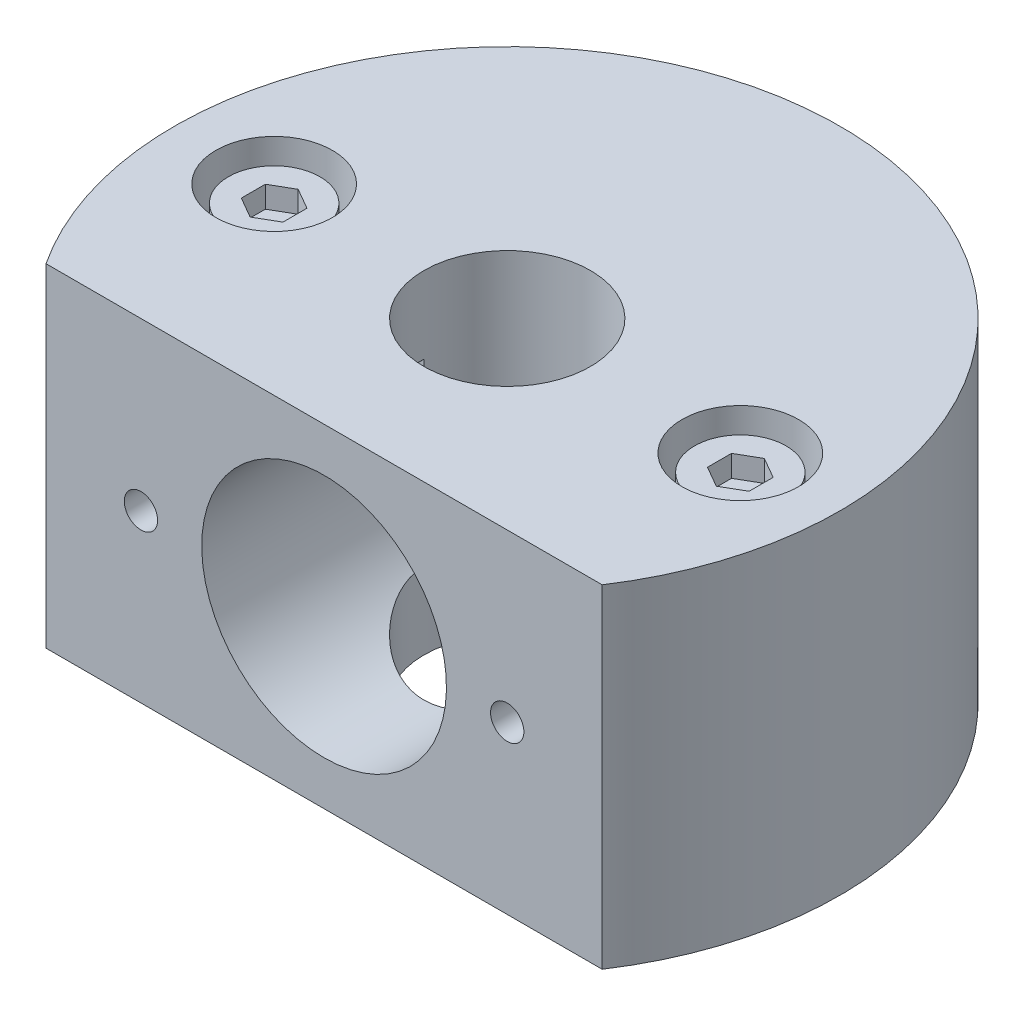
ISO-10303-21;
HEADER;
FILE_DESCRIPTION(('STEP AP214'),'2;1');
FILE_NAME('part.step','',(''),(''),'','','');
FILE_SCHEMA(('AUTOMOTIVE_DESIGN { 1 0 10303 214 1 1 1 1 }'));
ENDSEC;
DATA;
#1=APPLICATION_CONTEXT('core data for automotive mechanical design processes');
#2=APPLICATION_PROTOCOL_DEFINITION('international standard','automotive_design',2000,#1);
#3=PRODUCT_CONTEXT('',#1,'mechanical');
#4=PRODUCT('Part','Part','',(#3));
#5=PRODUCT_RELATED_PRODUCT_CATEGORY('part','',(#4));
#6=PRODUCT_DEFINITION_FORMATION('','',#4);
#7=PRODUCT_DEFINITION_CONTEXT('part definition',#1,'design');
#8=PRODUCT_DEFINITION('design','',#6,#7);
#9=PRODUCT_DEFINITION_SHAPE('','',#8);
#10=(LENGTH_UNIT() NAMED_UNIT(*) SI_UNIT(.MILLI.,.METRE.));
#11=(NAMED_UNIT(*) PLANE_ANGLE_UNIT() SI_UNIT($,.RADIAN.));
#12=(NAMED_UNIT(*) SI_UNIT($,.STERADIAN.) SOLID_ANGLE_UNIT());
#13=UNCERTAINTY_MEASURE_WITH_UNIT(LENGTH_MEASURE(1.E-05),#10,'distance_accuracy_value','');
#14=(GEOMETRIC_REPRESENTATION_CONTEXT(3) GLOBAL_UNCERTAINTY_ASSIGNED_CONTEXT((#13)) GLOBAL_UNIT_ASSIGNED_CONTEXT((#10,
#11,#12)) REPRESENTATION_CONTEXT('',''));
#15=CARTESIAN_POINT('',(0.,0.,0.));
#16=DIRECTION('',(0.,0.,1.));
#17=DIRECTION('',(1.,0.,0.));
#18=AXIS2_PLACEMENT_3D('',#15,#16,#17);
#19=CARTESIAN_POINT('',(-1.39659253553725E-13,20.,0.));
#20=DIRECTION('',(0.,-1.,0.));
#21=DIRECTION('',(1.,0.,0.));
#22=AXIS2_PLACEMENT_3D('',#19,#20,#21);
#23=CYLINDRICAL_SURFACE('',#22,20.);
#24=DIRECTION('',(0.,-1.,0.));
#25=VECTOR('',#24,1.);
#26=CARTESIAN_POINT('',(16.7032930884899,20.,11.));
#27=LINE('',#26,#25);
#28=CARTESIAN_POINT('',(16.7032930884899,20.,11.));
#29=VERTEX_POINT('',#28);
#30=CARTESIAN_POINT('',(16.70329308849,1.55044766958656E-13,11.));
#31=VERTEX_POINT('',#30);
#32=EDGE_CURVE('E253',#29,#31,#27,.T.);
#33=ORIENTED_EDGE('',*,*,#32,.T.);
#34=CARTESIAN_POINT('',(0.,0.,0.));
#35=DIRECTION('',(0.,1.,0.));
#36=DIRECTION('',(-1.,0.,0.));
#37=AXIS2_PLACEMENT_3D('',#34,#35,#36);
#38=CIRCLE('',#37,20.);
#39=CARTESIAN_POINT('',(-16.70329308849,0.,11.));
#40=VERTEX_POINT('',#39);
#41=EDGE_CURVE('E27',#31,#40,#38,.T.);
#42=ORIENTED_EDGE('',*,*,#41,.T.);
#43=DIRECTION('',(0.,-1.,0.));
#44=VECTOR('',#43,1.);
#45=CARTESIAN_POINT('',(-16.7032930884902,20.,11.));
#46=LINE('',#45,#44);
#47=CARTESIAN_POINT('',(-16.7032930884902,20.,11.));
#48=VERTEX_POINT('',#47);
#49=EDGE_CURVE('E255',#48,#40,#46,.T.);
#50=ORIENTED_EDGE('',*,*,#49,.F.);
#51=CARTESIAN_POINT('',(-1.39659253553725E-13,20.,0.));
#52=DIRECTION('',(0.,1.,0.));
#53=DIRECTION('',(-1.,0.,0.));
#54=AXIS2_PLACEMENT_3D('',#51,#52,#53);
#55=CIRCLE('',#54,20.);
#56=EDGE_CURVE('E414',#29,#48,#55,.T.);
#57=ORIENTED_EDGE('',*,*,#56,.F.);
#58=EDGE_LOOP('',(#33,#42,#50,#57));
#59=FACE_BOUND('',#58,.T.);
#60=ADVANCED_FACE('F14',(#59),#23,.T.);
#61=CARTESIAN_POINT('',(10.2,10.,7.));
#62=DIRECTION('',(0.,0.,-1.));
#63=DIRECTION('',(0.,-1.,0.));
#64=AXIS2_PLACEMENT_3D('',#61,#62,#63);
#65=PLANE('',#64);
#66=CARTESIAN_POINT('',(11.,10.,7.));
#67=DIRECTION('',(0.,0.,1.));
#68=DIRECTION('',(0.,1.,0.));
#69=AXIS2_PLACEMENT_3D('',#66,#67,#68);
#70=CIRCLE('',#69,1.);
#71=CARTESIAN_POINT('',(11.,11.,7.));
#72=VERTEX_POINT('',#71);
#73=EDGE_CURVE('E243',#72,#72,#70,.T.);
#74=ORIENTED_EDGE('',*,*,#73,.T.);
#75=EDGE_LOOP('',(#74));
#76=FACE_BOUND('',#75,.T.);
#77=ADVANCED_FACE('F296',(#76),#65,.F.);
#78=CARTESIAN_POINT('',(11.,10.0000000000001,11.));
#79=DIRECTION('',(0.,0.,1.));
#80=DIRECTION('',(0.,1.,0.));
#81=AXIS2_PLACEMENT_3D('',#78,#79,#80);
#82=CYLINDRICAL_SURFACE('',#81,1.);
#83=ORIENTED_EDGE('',*,*,#73,.F.);
#84=EDGE_LOOP('',(#83));
#85=FACE_BOUND('',#84,.T.);
#86=CARTESIAN_POINT('',(11.,10.0000000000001,11.));
#87=DIRECTION('',(0.,0.,-1.));
#88=DIRECTION('',(0.,-1.,0.));
#89=AXIS2_PLACEMENT_3D('',#86,#87,#88);
#90=CIRCLE('',#89,1.);
#91=CARTESIAN_POINT('',(11.,9.00000000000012,11.));
#92=VERTEX_POINT('',#91);
#93=EDGE_CURVE('E235',#92,#92,#90,.F.);
#94=ORIENTED_EDGE('',*,*,#93,.T.);
#95=EDGE_LOOP('',(#94));
#96=FACE_BOUND('',#95,.T.);
#97=ADVANCED_FACE('F299',(#85,#96),#82,.F.);
#98=CARTESIAN_POINT('',(-14.0000000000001,20.,0.));
#99=DIRECTION('',(0.,1.,0.));
#100=DIRECTION('',(-1.,0.,0.));
#101=AXIS2_PLACEMENT_3D('',#98,#99,#100);
#102=CYLINDRICAL_SURFACE('',#101,3.5);
#103=CARTESIAN_POINT('',(-14.,16.,0.));
#104=DIRECTION('',(0.,1.,0.));
#105=DIRECTION('',(-1.,0.,0.));
#106=AXIS2_PLACEMENT_3D('',#103,#104,#105);
#107=CIRCLE('',#106,3.5);
#108=CARTESIAN_POINT('',(-17.5,16.,0.));
#109=VERTEX_POINT('',#108);
#110=EDGE_CURVE('E239',#109,#109,#107,.T.);
#111=ORIENTED_EDGE('',*,*,#110,.F.);
#112=EDGE_LOOP('',(#111));
#113=FACE_BOUND('',#112,.T.);
#114=CARTESIAN_POINT('',(-14.0000000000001,20.,0.));
#115=DIRECTION('',(0.,1.,0.));
#116=DIRECTION('',(-1.,0.,0.));
#117=AXIS2_PLACEMENT_3D('',#114,#115,#116);
#118=CIRCLE('',#117,3.5);
#119=CARTESIAN_POINT('',(-17.5000000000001,20.,0.));
#120=VERTEX_POINT('',#119);
#121=EDGE_CURVE('E478',#120,#120,#118,.T.);
#122=ORIENTED_EDGE('',*,*,#121,.T.);
#123=EDGE_LOOP('',(#122));
#124=FACE_BOUND('',#123,.T.);
#125=ADVANCED_FACE('F304',(#113,#124),#102,.F.);
#126=CARTESIAN_POINT('',(-17.5,16.,0.));
#127=DIRECTION('',(0.,-1.,0.));
#128=DIRECTION('',(1.,0.,0.));
#129=AXIS2_PLACEMENT_3D('',#126,#127,#128);
#130=PLANE('',#129);
#131=CARTESIAN_POINT('',(-14.,16.,0.));
#132=DIRECTION('',(0.,-1.,0.));
#133=DIRECTION('',(1.,0.,0.));
#134=AXIS2_PLACEMENT_3D('',#131,#132,#133);
#135=CIRCLE('',#134,2.75);
#136=CARTESIAN_POINT('',(-11.25,16.,0.));
#137=VERTEX_POINT('',#136);
#138=EDGE_CURVE('E9',#137,#137,#135,.F.);
#139=ORIENTED_EDGE('',*,*,#138,.F.);
#140=EDGE_LOOP('',(#139));
#141=FACE_BOUND('',#140,.T.);
#142=ORIENTED_EDGE('',*,*,#110,.T.);
#143=EDGE_LOOP('',(#142));
#144=FACE_BOUND('',#143,.T.);
#145=ADVANCED_FACE('F301',(#141,#144),#130,.F.);
#146=CARTESIAN_POINT('',(-14.0000000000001,20.,0.));
#147=DIRECTION('',(0.,1.,0.));
#148=DIRECTION('',(-1.,0.,0.));
#149=AXIS2_PLACEMENT_3D('',#146,#147,#148);
#150=CYLINDRICAL_SURFACE('',#149,1.75);
#151=CARTESIAN_POINT('',(-14.,16.,0.));
#152=DIRECTION('',(0.,1.,0.));
#153=DIRECTION('',(-1.,0.,0.));
#154=AXIS2_PLACEMENT_3D('',#151,#152,#153);
#155=CIRCLE('',#154,1.75);
#156=CARTESIAN_POINT('',(-15.75,16.,0.));
#157=VERTEX_POINT('',#156);
#158=EDGE_CURVE('E135',#157,#157,#155,.F.);
#159=ORIENTED_EDGE('',*,*,#158,.F.);
#160=EDGE_LOOP('',(#159));
#161=FACE_BOUND('',#160,.T.);
#162=CARTESIAN_POINT('',(-14.,0.,0.));
#163=DIRECTION('',(0.,1.,0.));
#164=DIRECTION('',(-1.,0.,0.));
#165=AXIS2_PLACEMENT_3D('',#162,#163,#164);
#166=CIRCLE('',#165,1.75);
#167=CARTESIAN_POINT('',(-15.75,-1.09981662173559E-13,0.));
#168=VERTEX_POINT('',#167);
#169=EDGE_CURVE('E481',#168,#168,#166,.T.);
#170=ORIENTED_EDGE('',*,*,#169,.F.);
#171=EDGE_LOOP('',(#170));
#172=FACE_BOUND('',#171,.T.);
#173=ADVANCED_FACE('F294',(#161,#172),#150,.F.);
#174=CARTESIAN_POINT('',(-11.8,10.,7.));
#175=DIRECTION('',(0.,0.,-1.));
#176=DIRECTION('',(0.,-1.,0.));
#177=AXIS2_PLACEMENT_3D('',#174,#175,#176);
#178=PLANE('',#177);
#179=CARTESIAN_POINT('',(-11.,10.,7.));
#180=DIRECTION('',(0.,0.,1.));
#181=DIRECTION('',(0.,1.,0.));
#182=AXIS2_PLACEMENT_3D('',#179,#180,#181);
#183=CIRCLE('',#182,1.);
#184=CARTESIAN_POINT('',(-11.,11.,7.));
#185=VERTEX_POINT('',#184);
#186=EDGE_CURVE('E246',#185,#185,#183,.T.);
#187=ORIENTED_EDGE('',*,*,#186,.T.);
#188=EDGE_LOOP('',(#187));
#189=FACE_BOUND('',#188,.T.);
#190=ADVANCED_FACE('F290',(#189),#178,.F.);
#191=CARTESIAN_POINT('',(-11.,10.,11.));
#192=DIRECTION('',(0.,0.,1.));
#193=DIRECTION('',(0.,1.,0.));
#194=AXIS2_PLACEMENT_3D('',#191,#192,#193);
#195=CYLINDRICAL_SURFACE('',#194,1.);
#196=ORIENTED_EDGE('',*,*,#186,.F.);
#197=EDGE_LOOP('',(#196));
#198=FACE_BOUND('',#197,.T.);
#199=CARTESIAN_POINT('',(-11.,10.,11.));
#200=DIRECTION('',(0.,0.,-1.));
#201=DIRECTION('',(0.,-1.,0.));
#202=AXIS2_PLACEMENT_3D('',#199,#200,#201);
#203=CIRCLE('',#202,1.);
#204=CARTESIAN_POINT('',(-11.,9.,11.));
#205=VERTEX_POINT('',#204);
#206=EDGE_CURVE('E240',#205,#205,#203,.F.);
#207=ORIENTED_EDGE('',*,*,#206,.T.);
#208=EDGE_LOOP('',(#207));
#209=FACE_BOUND('',#208,.T.);
#210=ADVANCED_FACE('F293',(#198,#209),#195,.F.);
#211=CARTESIAN_POINT('',(0.,0.,0.));
#212=DIRECTION('',(0.,1.,0.));
#213=DIRECTION('',(-1.,0.,0.));
#214=AXIS2_PLACEMENT_3D('',#211,#212,#213);
#215=PLANE('',#214);
#216=ORIENTED_EDGE('',*,*,#41,.F.);
#217=DIRECTION('',(1.,0.,0.));
#218=VECTOR('',#217,1.);
#219=CARTESIAN_POINT('',(16.70329308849,1.55044766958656E-13,11.));
#220=LINE('',#219,#218);
#221=EDGE_CURVE('E418',#40,#31,#220,.T.);
#222=ORIENTED_EDGE('',*,*,#221,.F.);
#223=EDGE_LOOP('',(#216,#222));
#224=FACE_BOUND('',#223,.T.);
#225=ORIENTED_EDGE('',*,*,#169,.T.);
#226=EDGE_LOOP('',(#225));
#227=FACE_BOUND('',#226,.T.);
#228=CARTESIAN_POINT('',(0.,0.,0.));
#229=DIRECTION('',(0.,1.,0.));
#230=DIRECTION('',(-1.,0.,0.));
#231=AXIS2_PLACEMENT_3D('',#228,#229,#230);
#232=CIRCLE('',#231,5.);
#233=CARTESIAN_POINT('',(-5.,0.,0.));
#234=VERTEX_POINT('',#233);
#235=EDGE_CURVE('E496',#234,#234,#232,.T.);
#236=ORIENTED_EDGE('',*,*,#235,.T.);
#237=EDGE_LOOP('',(#236));
#238=FACE_BOUND('',#237,.T.);
#239=CARTESIAN_POINT('',(14.,0.,0.));
#240=DIRECTION('',(0.,1.,0.));
#241=DIRECTION('',(-1.,0.,0.));
#242=AXIS2_PLACEMENT_3D('',#239,#240,#241);
#243=CIRCLE('',#242,1.75);
#244=CARTESIAN_POINT('',(12.25,0.,0.));
#245=VERTEX_POINT('',#244);
#246=EDGE_CURVE('E428',#245,#245,#243,.T.);
#247=ORIENTED_EDGE('',*,*,#246,.T.);
#248=EDGE_LOOP('',(#247));
#249=FACE_BOUND('',#248,.T.);
#250=ADVANCED_FACE('F444',(#224,#227,#238,#249),#215,.F.);
#251=CARTESIAN_POINT('',(-1.39659253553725E-13,20.,0.));
#252=DIRECTION('',(0.,1.,0.));
#253=DIRECTION('',(-1.,0.,0.));
#254=AXIS2_PLACEMENT_3D('',#251,#252,#253);
#255=PLANE('',#254);
#256=ORIENTED_EDGE('',*,*,#121,.F.);
#257=EDGE_LOOP('',(#256));
#258=FACE_BOUND('',#257,.T.);
#259=DIRECTION('',(1.,0.,0.));
#260=VECTOR('',#259,1.);
#261=CARTESIAN_POINT('',(16.7032930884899,20.,11.));
#262=LINE('',#261,#260);
#263=EDGE_CURVE('E417',#48,#29,#262,.T.);
#264=ORIENTED_EDGE('',*,*,#263,.T.);
#265=ORIENTED_EDGE('',*,*,#56,.T.);
#266=EDGE_LOOP('',(#264,#265));
#267=FACE_BOUND('',#266,.T.);
#268=CARTESIAN_POINT('',(-1.39659253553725E-13,20.,0.));
#269=DIRECTION('',(0.,1.,0.));
#270=DIRECTION('',(-1.,0.,0.));
#271=AXIS2_PLACEMENT_3D('',#268,#269,#270);
#272=CIRCLE('',#271,5.);
#273=CARTESIAN_POINT('',(-5.00000000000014,20.,0.));
#274=VERTEX_POINT('',#273);
#275=EDGE_CURVE('E484',#274,#274,#272,.T.);
#276=ORIENTED_EDGE('',*,*,#275,.F.);
#277=EDGE_LOOP('',(#276));
#278=FACE_BOUND('',#277,.T.);
#279=CARTESIAN_POINT('',(13.9999999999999,20.,0.));
#280=DIRECTION('',(0.,1.,0.));
#281=DIRECTION('',(-1.,0.,0.));
#282=AXIS2_PLACEMENT_3D('',#279,#280,#281);
#283=CIRCLE('',#282,3.5);
#284=CARTESIAN_POINT('',(10.4999999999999,20.,0.));
#285=VERTEX_POINT('',#284);
#286=EDGE_CURVE('E420',#285,#285,#283,.T.);
#287=ORIENTED_EDGE('',*,*,#286,.F.);
#288=EDGE_LOOP('',(#287));
#289=FACE_BOUND('',#288,.T.);
#290=ADVANCED_FACE('F442',(#258,#267,#278,#289),#255,.T.);
#291=CARTESIAN_POINT('',(16.7032930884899,20.,11.));
#292=DIRECTION('',(0.,0.,-1.));
#293=DIRECTION('',(0.,-1.,0.));
#294=AXIS2_PLACEMENT_3D('',#291,#292,#293);
#295=PLANE('',#294);
#296=ORIENTED_EDGE('',*,*,#93,.F.);
#297=EDGE_LOOP('',(#296));
#298=FACE_BOUND('',#297,.T.);
#299=ORIENTED_EDGE('',*,*,#206,.F.);
#300=EDGE_LOOP('',(#299));
#301=FACE_BOUND('',#300,.T.);
#302=CARTESIAN_POINT('',(0.,10.,11.));
#303=DIRECTION('',(0.,0.,-1.));
#304=DIRECTION('',(0.,-1.,0.));
#305=AXIS2_PLACEMENT_3D('',#302,#303,#304);
#306=CIRCLE('',#305,7.35);
#307=CARTESIAN_POINT('',(0.,2.65,11.));
#308=VERTEX_POINT('',#307);
#309=EDGE_CURVE('E422',#308,#308,#306,.F.);
#310=ORIENTED_EDGE('',*,*,#309,.F.);
#311=EDGE_LOOP('',(#310));
#312=FACE_BOUND('',#311,.T.);
#313=ORIENTED_EDGE('',*,*,#49,.T.);
#314=ORIENTED_EDGE('',*,*,#221,.T.);
#315=ORIENTED_EDGE('',*,*,#32,.F.);
#316=ORIENTED_EDGE('',*,*,#263,.F.);
#317=EDGE_LOOP('',(#313,#314,#315,#316));
#318=FACE_BOUND('',#317,.T.);
#319=ADVANCED_FACE('F416',(#298,#301,#312,#318),#295,.F.);
#320=CARTESIAN_POINT('',(0.,10.,0.));
#321=DIRECTION('',(0.,0.,1.));
#322=DIRECTION('',(0.,1.,0.));
#323=AXIS2_PLACEMENT_3D('',#320,#321,#322);
#324=PLANE('',#323);
#325=CARTESIAN_POINT('',(0.,10.,0.));
#326=DIRECTION('',(0.,0.,1.));
#327=DIRECTION('',(0.,1.,0.));
#328=AXIS2_PLACEMENT_3D('',#325,#326,#327);
#329=CIRCLE('',#328,7.35);
#330=CARTESIAN_POINT('',(-5.00000000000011,15.387253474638,0.));
#331=VERTEX_POINT('',#330);
#332=CARTESIAN_POINT('',(-5.,4.6127465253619,0.));
#333=VERTEX_POINT('',#332);
#334=EDGE_CURVE('E250',#331,#333,#329,.T.);
#335=ORIENTED_EDGE('',*,*,#334,.T.);
#336=DIRECTION('',(0.,-1.,0.));
#337=VECTOR('',#336,1.);
#338=CARTESIAN_POINT('',(-5.00000000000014,20.,0.));
#339=LINE('',#338,#337);
#340=EDGE_CURVE('E497',#331,#333,#339,.T.);
#341=ORIENTED_EDGE('',*,*,#340,.F.);
#342=EDGE_LOOP('',(#335,#341));
#343=FACE_BOUND('',#342,.T.);
#344=ADVANCED_FACE('F288',(#343),#324,.T.);
#345=CARTESIAN_POINT('',(5.,4.61274652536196,0.));
#346=VERTEX_POINT('',#345);
#347=CARTESIAN_POINT('',(4.99999999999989,15.3872534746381,0.));
#348=VERTEX_POINT('',#347);
#349=EDGE_CURVE('E249',#346,#348,#329,.T.);
#350=ORIENTED_EDGE('',*,*,#349,.T.);
#351=DIRECTION('',(0.,-1.,0.));
#352=VECTOR('',#351,1.);
#353=CARTESIAN_POINT('',(4.99999999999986,20.,0.));
#354=LINE('',#353,#352);
#355=EDGE_CURVE('E258',#346,#348,#354,.F.);
#356=ORIENTED_EDGE('',*,*,#355,.F.);
#357=EDGE_LOOP('',(#350,#356));
#358=FACE_BOUND('',#357,.T.);
#359=ADVANCED_FACE('F283',(#358),#324,.T.);
#360=CARTESIAN_POINT('',(0.,10.,11.));
#361=DIRECTION('',(0.,0.,-1.));
#362=DIRECTION('',(0.,-1.,0.));
#363=AXIS2_PLACEMENT_3D('',#360,#361,#362);
#364=CYLINDRICAL_SURFACE('',#363,7.35);
#365=ORIENTED_EDGE('',*,*,#309,.T.);
#366=EDGE_LOOP('',(#365));
#367=FACE_BOUND('',#366,.T.);
#368=ORIENTED_EDGE('',*,*,#349,.F.);
#369=CARTESIAN_POINT('',(-5.,4.6127465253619,0.));
#370=CARTESIAN_POINT('',(-5.00003361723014,4.61281834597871,0.122133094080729));
#371=CARTESIAN_POINT('',(-4.99552679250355,4.60859531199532,0.244223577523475));
#372=CARTESIAN_POINT('',(-4.97769983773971,4.59211071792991,0.487043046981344));
#373=CARTESIAN_POINT('',(-4.96439234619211,4.57986068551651,0.607773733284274));
#374=CARTESIAN_POINT('',(-4.92941139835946,4.54803518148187,0.845721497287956));
#375=CARTESIAN_POINT('',(-4.90782555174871,4.52853648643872,0.9629619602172));
#376=CARTESIAN_POINT('',(-4.85668385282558,4.4830898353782,1.19443371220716));
#377=CARTESIAN_POINT('',(-4.82712549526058,4.45713985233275,1.30866404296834));
#378=CARTESIAN_POINT('',(-4.76066671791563,4.39995924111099,1.53285682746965));
#379=CARTESIAN_POINT('',(-4.72380837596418,4.36875902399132,1.64283961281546));
#380=CARTESIAN_POINT('',(-4.64307658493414,4.30201036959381,1.85879802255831));
#381=CARTESIAN_POINT('',(-4.59920353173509,4.26646217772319,1.96477387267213));
#382=CARTESIAN_POINT('',(-4.45736954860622,4.15458694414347,2.2768816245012));
#383=CARTESIAN_POINT('',(-4.34934830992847,4.07316834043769,2.47668133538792));
#384=CARTESIAN_POINT('',(-4.0893596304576,3.89027233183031,2.88890839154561));
#385=CARTESIAN_POINT('',(-3.93310765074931,3.78768226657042,3.09813691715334));
#386=CARTESIAN_POINT('',(-3.6758069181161,3.63439079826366,3.39196030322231));
#387=CARTESIAN_POINT('',(-3.58616481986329,3.5833651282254,3.4866106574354));
#388=CARTESIAN_POINT('',(-3.39937317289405,3.48248399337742,3.66896471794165));
#389=CARTESIAN_POINT('',(-3.3022218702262,3.4326288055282,3.75666679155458));
#390=CARTESIAN_POINT('',(-3.08512854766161,3.32758068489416,3.937627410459));
#391=CARTESIAN_POINT('',(-2.96398221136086,3.27275008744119,4.02965746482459));
#392=CARTESIAN_POINT('',(-2.7125454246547,3.16749202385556,4.20302338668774));
#393=CARTESIAN_POINT('',(-2.5822591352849,3.11706257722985,4.28436407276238));
#394=CARTESIAN_POINT('',(-2.31324355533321,3.02205529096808,4.43538669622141));
#395=CARTESIAN_POINT('',(-2.17452377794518,2.97747103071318,4.50508144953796));
#396=CARTESIAN_POINT('',(-1.88949733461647,2.89547222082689,4.63186182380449));
#397=CARTESIAN_POINT('',(-1.74319375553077,2.85805478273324,4.68895252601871));
#398=CARTESIAN_POINT('',(-1.37141990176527,2.7755055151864,4.81393946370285));
#399=CARTESIAN_POINT('',(-1.14195858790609,2.73542941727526,4.87365393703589));
#400=CARTESIAN_POINT('',(-0.67434458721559,2.67721157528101,4.96001490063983));
#401=CARTESIAN_POINT('',(-0.436198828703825,2.65905272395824,4.98668718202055));
#402=CARTESIAN_POINT('',(0.0425352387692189,2.6462193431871,5.0055612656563));
#403=CARTESIAN_POINT('',(0.283127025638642,2.6515849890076,4.99770409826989));
#404=CARTESIAN_POINT('',(0.759092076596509,2.68540783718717,4.94783657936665));
#405=CARTESIAN_POINT('',(0.994463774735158,2.71387187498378,4.90581611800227));
#406=CARTESIAN_POINT('',(1.44926191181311,2.79067293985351,4.79099893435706));
#407=CARTESIAN_POINT('',(1.66890362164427,2.8386301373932,4.71878972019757));
#408=CARTESIAN_POINT('',(2.09258390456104,2.95076777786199,4.54680317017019));
#409=CARTESIAN_POINT('',(2.29661970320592,3.01495109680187,4.44702094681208));
#410=CARTESIAN_POINT('',(2.70821939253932,3.16324970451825,4.2104749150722));
#411=CARTESIAN_POINT('',(2.91358925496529,3.24879613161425,4.070810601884));
#412=CARTESIAN_POINT('',(3.29943656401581,3.42872998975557,3.76489679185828));
#413=CARTESIAN_POINT('',(3.47988438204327,3.52312772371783,3.5986161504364));
#414=CARTESIAN_POINT('',(3.74466519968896,3.67444216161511,3.3163064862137));
#415=CARTESIAN_POINT('',(3.83782034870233,3.7306650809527,3.20804088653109));
#416=CARTESIAN_POINT('',(4.01469837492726,3.8424306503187,2.98372378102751));
#417=CARTESIAN_POINT('',(4.09841927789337,3.89797315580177,2.86767065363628));
#418=CARTESIAN_POINT('',(4.33478475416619,4.06126123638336,2.50834823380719));
#419=CARTESIAN_POINT('',(4.47288988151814,4.16582141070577,2.25364162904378));
#420=CARTESIAN_POINT('',(4.67663872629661,4.32864283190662,1.78260949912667));
#421=CARTESIAN_POINT('',(4.75174476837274,4.39197207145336,1.5721521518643));
#422=CARTESIAN_POINT('',(4.84328614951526,4.47128481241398,1.24708650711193));
#423=CARTESIAN_POINT('',(4.87026113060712,4.49509021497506,1.13730147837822));
#424=CARTESIAN_POINT('',(4.91685888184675,4.53667009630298,0.915082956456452));
#425=CARTESIAN_POINT('',(4.93648488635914,4.55444722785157,0.802650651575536));
#426=CARTESIAN_POINT('',(4.96805229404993,4.58322598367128,0.575806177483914));
#427=CARTESIAN_POINT('',(4.97999126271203,4.59422546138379,0.461393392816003));
#428=CARTESIAN_POINT('',(4.99598638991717,4.6090218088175,0.231333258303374));
#429=CARTESIAN_POINT('',(5.00002695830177,4.61280443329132,0.115683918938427));
#430=CARTESIAN_POINT('',(5.,4.61274652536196,0.));
#431=B_SPLINE_CURVE_WITH_KNOTS('',3,(#369,#370,#371,#372,#373,#374,#375,#376,#377,#378,#379,
#380,#381,#382,#383,#384,#385,#386,#387,#388,#389,#390,#391,#392,#393,#394,#395,#396,#397,#398,
#399,#400,#401,#402,#403,#404,#405,#406,#407,#408,#409,#410,#411,#412,#413,#414,#415,#416,#417,
#418,#419,#420,#421,#422,#423,#424,#425,#426,#427,#428,#429,#430),.UNSPECIFIED.,.F.,.F.,(4,2,2,
2,2,2,2,2,2,2,2,2,2,2,2,2,2,2,2,2,2,2,2,2,2,2,2,2,2,2,4),(0.,0.366175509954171,
0.731826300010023,1.09370968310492,1.45570691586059,1.81567529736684,2.17562337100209,
2.89716216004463,3.73560342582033,4.1552785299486,4.57505195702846,5.05955348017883,
5.54383584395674,6.02758171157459,6.51113220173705,7.22913182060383,7.94657065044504,
8.66523520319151,9.38411250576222,10.0896068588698,10.7952263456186,11.5803712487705,
12.3664416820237,12.8264706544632,13.2865957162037,14.2056391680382,14.8997002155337,
15.2459242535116,15.5919957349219,15.9381767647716,16.2850404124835),.UNSPECIFIED.);
#432=EDGE_CURVE('E261',#333,#346,#431,.T.);
#433=ORIENTED_EDGE('',*,*,#432,.F.);
#434=ORIENTED_EDGE('',*,*,#334,.F.);
#435=CARTESIAN_POINT('',(4.99999999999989,15.3872534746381,0.));
#436=CARTESIAN_POINT('',(5.00003361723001,15.3871816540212,0.122133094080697));
#437=CARTESIAN_POINT('',(4.99552679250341,15.3914046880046,0.244223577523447));
#438=CARTESIAN_POINT('',(4.97769983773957,15.40788928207,0.487043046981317));
#439=CARTESIAN_POINT('',(4.96439234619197,15.4201393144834,0.607773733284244));
#440=CARTESIAN_POINT('',(4.92941139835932,15.4519648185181,0.84572149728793));
#441=CARTESIAN_POINT('',(4.90782555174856,15.4714635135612,0.962961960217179));
#442=CARTESIAN_POINT('',(4.85668385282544,15.5169101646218,1.19443371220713));
#443=CARTESIAN_POINT('',(4.82712549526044,15.5428601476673,1.3086640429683));
#444=CARTESIAN_POINT('',(4.76066671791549,15.6000407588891,1.53285682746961));
#445=CARTESIAN_POINT('',(4.72380837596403,15.6312409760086,1.64283961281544));
#446=CARTESIAN_POINT('',(4.64307658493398,15.6979896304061,1.8587980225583));
#447=CARTESIAN_POINT('',(4.59920353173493,15.7335378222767,1.96477387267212));
#448=CARTESIAN_POINT('',(4.45736954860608,15.8454130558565,2.27688162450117));
#449=CARTESIAN_POINT('',(4.34934830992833,15.9268316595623,2.47668133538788));
#450=CARTESIAN_POINT('',(4.08935963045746,16.1097276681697,2.88890839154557));
#451=CARTESIAN_POINT('',(3.93310765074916,16.2123177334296,3.09813691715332));
#452=CARTESIAN_POINT('',(3.67580691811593,16.3656092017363,3.39196030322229));
#453=CARTESIAN_POINT('',(3.58616481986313,16.4166348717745,3.48661065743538));
#454=CARTESIAN_POINT('',(3.3993731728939,16.5175160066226,3.66896471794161));
#455=CARTESIAN_POINT('',(3.30222187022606,16.5673711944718,3.75666679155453));
#456=CARTESIAN_POINT('',(3.08512854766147,16.6724193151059,3.93762741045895));
#457=CARTESIAN_POINT('',(2.96398221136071,16.7272499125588,4.02965746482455));
#458=CARTESIAN_POINT('',(2.71254542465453,16.8325079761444,4.20302338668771));
#459=CARTESIAN_POINT('',(2.58225913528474,16.8829374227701,4.28436407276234));
#460=CARTESIAN_POINT('',(2.31324355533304,16.9779447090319,4.43538669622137));
#461=CARTESIAN_POINT('',(2.17452377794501,17.0225289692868,4.50508144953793));
#462=CARTESIAN_POINT('',(1.8894973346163,17.1045277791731,4.63186182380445));
#463=CARTESIAN_POINT('',(1.74319375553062,17.1419452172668,4.68895252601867));
#464=CARTESIAN_POINT('',(1.37141990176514,17.2244944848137,4.81393946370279));
#465=CARTESIAN_POINT('',(1.14195858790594,17.2645705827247,4.87365393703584));
#466=CARTESIAN_POINT('',(0.674344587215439,17.3227884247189,4.96001490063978));
#467=CARTESIAN_POINT('',(0.436198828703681,17.3409472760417,4.9866871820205));
#468=CARTESIAN_POINT('',(-0.0425352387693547,17.3537806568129,5.00556126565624));
#469=CARTESIAN_POINT('',(-0.283127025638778,17.3484150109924,4.99770409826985));
#470=CARTESIAN_POINT('',(-0.759092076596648,17.3145921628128,4.9478365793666));
#471=CARTESIAN_POINT('',(-0.994463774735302,17.2861281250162,4.90581611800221));
#472=CARTESIAN_POINT('',(-1.44926191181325,17.2093270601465,4.79099893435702));
#473=CARTESIAN_POINT('',(-1.6689036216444,17.1613698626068,4.71878972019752));
#474=CARTESIAN_POINT('',(-2.09258390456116,17.049232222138,4.54680317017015));
#475=CARTESIAN_POINT('',(-2.29661970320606,16.9850489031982,4.44702094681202));
#476=CARTESIAN_POINT('',(-2.70821939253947,16.8367502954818,4.21047491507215));
#477=CARTESIAN_POINT('',(-2.91358925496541,16.7512038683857,4.07081060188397));
#478=CARTESIAN_POINT('',(-3.29943656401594,16.5712700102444,3.76489679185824));
#479=CARTESIAN_POINT('',(-3.47988438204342,16.4768722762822,3.59861615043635));
#480=CARTESIAN_POINT('',(-3.7446651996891,16.3255578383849,3.31630648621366));
#481=CARTESIAN_POINT('',(-3.83782034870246,16.2693349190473,3.20804088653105));
#482=CARTESIAN_POINT('',(-4.01469837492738,16.1575693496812,2.98372378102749));
#483=CARTESIAN_POINT('',(-4.09841927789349,16.1020268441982,2.86767065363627));
#484=CARTESIAN_POINT('',(-4.33478475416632,15.9387387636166,2.50834823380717));
#485=CARTESIAN_POINT('',(-4.47288988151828,15.8341785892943,2.25364162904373));
#486=CARTESIAN_POINT('',(-4.67663872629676,15.6713571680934,1.78260949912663));
#487=CARTESIAN_POINT('',(-4.75174476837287,15.6080279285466,1.57215215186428));
#488=CARTESIAN_POINT('',(-4.84328614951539,15.5287151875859,1.24708650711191));
#489=CARTESIAN_POINT('',(-4.87026113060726,15.5049097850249,1.13730147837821));
#490=CARTESIAN_POINT('',(-4.91685888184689,15.463329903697,0.915082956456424));
#491=CARTESIAN_POINT('',(-4.93648488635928,15.4455527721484,0.8026506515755));
#492=CARTESIAN_POINT('',(-4.96805229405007,15.4167740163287,0.575806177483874));
#493=CARTESIAN_POINT('',(-4.97999126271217,15.4057745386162,0.461393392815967));
#494=CARTESIAN_POINT('',(-4.9959863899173,15.3909781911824,0.231333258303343));
#495=CARTESIAN_POINT('',(-5.00002695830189,15.3871955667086,0.115683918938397));
#496=CARTESIAN_POINT('',(-5.00000000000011,15.387253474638,0.));
#497=B_SPLINE_CURVE_WITH_KNOTS('',3,(#435,#436,#437,#438,#439,#440,#441,#442,#443,#444,#445,
#446,#447,#448,#449,#450,#451,#452,#453,#454,#455,#456,#457,#458,#459,#460,#461,#462,#463,#464,
#465,#466,#467,#468,#469,#470,#471,#472,#473,#474,#475,#476,#477,#478,#479,#480,#481,#482,#483,
#484,#485,#486,#487,#488,#489,#490,#491,#492,#493,#494,#495,#496),.UNSPECIFIED.,.F.,.F.,(4,2,2,
2,2,2,2,2,2,2,2,2,2,2,2,2,2,2,2,2,2,2,2,2,2,2,2,2,2,2,4),(0.,0.366175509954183,
0.731826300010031,1.09370968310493,1.45570691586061,1.81567529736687,2.17562337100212,
2.89716216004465,3.73560342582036,4.15527852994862,4.57505195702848,5.05955348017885,
5.54383584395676,6.02758171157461,6.51113220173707,7.22913182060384,7.94657065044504,
8.66523520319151,9.38411250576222,10.0896068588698,10.7952263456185,11.5803712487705,
12.3664416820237,12.8264706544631,13.2865957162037,14.2056391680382,14.8997002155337,
15.2459242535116,15.5919957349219,15.9381767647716,16.2850404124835),.UNSPECIFIED.);
#498=EDGE_CURVE('E270',#348,#331,#497,.T.);
#499=ORIENTED_EDGE('',*,*,#498,.F.);
#500=EDGE_LOOP('',(#368,#433,#434,#499));
#501=FACE_BOUND('',#500,.T.);
#502=ADVANCED_FACE('F279',(#367,#501),#364,.F.);
#503=CARTESIAN_POINT('',(-1.39659253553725E-13,20.,0.));
#504=DIRECTION('',(0.,-1.,0.));
#505=DIRECTION('',(1.,0.,0.));
#506=AXIS2_PLACEMENT_3D('',#503,#504,#505);
#507=CYLINDRICAL_SURFACE('',#506,5.);
#508=ORIENTED_EDGE('',*,*,#235,.F.);
#509=EDGE_LOOP('',(#508));
#510=FACE_BOUND('',#509,.T.);
#511=ORIENTED_EDGE('',*,*,#275,.T.);
#512=EDGE_LOOP('',(#511));
#513=FACE_BOUND('',#512,.T.);
#514=ORIENTED_EDGE('',*,*,#498,.T.);
#515=ORIENTED_EDGE('',*,*,#340,.T.);
#516=ORIENTED_EDGE('',*,*,#432,.T.);
#517=ORIENTED_EDGE('',*,*,#355,.T.);
#518=EDGE_LOOP('',(#514,#515,#516,#517));
#519=FACE_BOUND('',#518,.T.);
#520=ADVANCED_FACE('F276',(#510,#513,#519),#507,.F.);
#521=CARTESIAN_POINT('',(13.9999999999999,20.,0.));
#522=DIRECTION('',(0.,1.,0.));
#523=DIRECTION('',(-1.,0.,0.));
#524=AXIS2_PLACEMENT_3D('',#521,#522,#523);
#525=CYLINDRICAL_SURFACE('',#524,3.5);
#526=CARTESIAN_POINT('',(14.,16.,0.));
#527=DIRECTION('',(0.,1.,0.));
#528=DIRECTION('',(-1.,0.,0.));
#529=AXIS2_PLACEMENT_3D('',#526,#527,#528);
#530=CIRCLE('',#529,3.5);
#531=CARTESIAN_POINT('',(10.5,16.,0.));
#532=VERTEX_POINT('',#531);
#533=EDGE_CURVE('E236',#532,#532,#530,.T.);
#534=ORIENTED_EDGE('',*,*,#533,.F.);
#535=EDGE_LOOP('',(#534));
#536=FACE_BOUND('',#535,.T.);
#537=ORIENTED_EDGE('',*,*,#286,.T.);
#538=EDGE_LOOP('',(#537));
#539=FACE_BOUND('',#538,.T.);
#540=ADVANCED_FACE('F310',(#536,#539),#525,.F.);
#541=CARTESIAN_POINT('',(10.5,16.,0.));
#542=DIRECTION('',(0.,-1.,0.));
#543=DIRECTION('',(1.,0.,0.));
#544=AXIS2_PLACEMENT_3D('',#541,#542,#543);
#545=PLANE('',#544);
#546=CARTESIAN_POINT('',(14.,16.,0.));
#547=DIRECTION('',(0.,-1.,0.));
#548=DIRECTION('',(1.,0.,0.));
#549=AXIS2_PLACEMENT_3D('',#546,#547,#548);
#550=CIRCLE('',#549,2.75);
#551=CARTESIAN_POINT('',(16.75,16.,0.));
#552=VERTEX_POINT('',#551);
#553=EDGE_CURVE('E21',#552,#552,#550,.F.);
#554=ORIENTED_EDGE('',*,*,#553,.F.);
#555=EDGE_LOOP('',(#554));
#556=FACE_BOUND('',#555,.T.);
#557=ORIENTED_EDGE('',*,*,#533,.T.);
#558=EDGE_LOOP('',(#557));
#559=FACE_BOUND('',#558,.T.);
#560=ADVANCED_FACE('F306',(#556,#559),#545,.F.);
#561=CARTESIAN_POINT('',(13.9999999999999,20.,0.));
#562=DIRECTION('',(0.,1.,0.));
#563=DIRECTION('',(-1.,0.,0.));
#564=AXIS2_PLACEMENT_3D('',#561,#562,#563);
#565=CYLINDRICAL_SURFACE('',#564,1.75);
#566=CARTESIAN_POINT('',(14.,16.,0.));
#567=DIRECTION('',(0.,1.,0.));
#568=DIRECTION('',(-1.,0.,0.));
#569=AXIS2_PLACEMENT_3D('',#566,#567,#568);
#570=CIRCLE('',#569,1.75);
#571=CARTESIAN_POINT('',(12.25,16.,0.));
#572=VERTEX_POINT('',#571);
#573=EDGE_CURVE('E232',#572,#572,#570,.F.);
#574=ORIENTED_EDGE('',*,*,#573,.F.);
#575=EDGE_LOOP('',(#574));
#576=FACE_BOUND('',#575,.T.);
#577=ORIENTED_EDGE('',*,*,#246,.F.);
#578=EDGE_LOOP('',(#577));
#579=FACE_BOUND('',#578,.T.);
#580=ADVANCED_FACE('F309',(#576,#579),#565,.F.);
#581=CARTESIAN_POINT('',(14.,-3.9999999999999,1.08942035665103E-13));
#582=DIRECTION('',(0.,1.,0.));
#583=DIRECTION('',(1.,0.,0.));
#584=AXIS2_PLACEMENT_3D('',#581,#582,#583);
#585=PLANE('',#584);
#586=CARTESIAN_POINT('',(14.,-3.9999999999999,1.08942035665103E-13));
#587=DIRECTION('',(0.,1.,0.));
#588=DIRECTION('',(1.,0.,0.));
#589=AXIS2_PLACEMENT_3D('',#586,#587,#588);
#590=CIRCLE('',#589,1.5);
#591=CARTESIAN_POINT('',(15.5,-3.99999999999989,1.19416479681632E-13));
#592=VERTEX_POINT('',#591);
#593=EDGE_CURVE('E224',#592,#592,#590,.T.);
#594=ORIENTED_EDGE('',*,*,#593,.F.);
#595=EDGE_LOOP('',(#594));
#596=FACE_BOUND('',#595,.T.);
#597=ADVANCED_FACE('F328',(#596),#585,.F.);
#598=CARTESIAN_POINT('',(14.,-3.9999999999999,1.08942035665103E-13));
#599=DIRECTION('',(0.,1.,0.));
#600=DIRECTION('',(1.,0.,0.));
#601=AXIS2_PLACEMENT_3D('',#598,#599,#600);
#602=CYLINDRICAL_SURFACE('',#601,1.5);
#603=ORIENTED_EDGE('',*,*,#593,.T.);
#604=EDGE_LOOP('',(#603));
#605=FACE_BOUND('',#604,.T.);
#606=CARTESIAN_POINT('',(14.,16.,0.));
#607=DIRECTION('',(0.,1.,0.));
#608=DIRECTION('',(1.,0.,0.));
#609=AXIS2_PLACEMENT_3D('',#606,#607,#608);
#610=CIRCLE('',#609,1.5);
#611=CARTESIAN_POINT('',(15.5,16.,0.));
#612=VERTEX_POINT('',#611);
#613=EDGE_CURVE('E213',#612,#612,#610,.T.);
#614=ORIENTED_EDGE('',*,*,#613,.F.);
#615=EDGE_LOOP('',(#614));
#616=FACE_BOUND('',#615,.T.);
#617=ADVANCED_FACE('F320',(#605,#616),#602,.T.);
#618=CARTESIAN_POINT('',(14.,16.,0.));
#619=DIRECTION('',(0.,1.,0.));
#620=DIRECTION('',(1.,0.,0.));
#621=AXIS2_PLACEMENT_3D('',#618,#619,#620);
#622=PLANE('',#621);
#623=ORIENTED_EDGE('',*,*,#613,.T.);
#624=EDGE_LOOP('',(#623));
#625=FACE_BOUND('',#624,.T.);
#626=ORIENTED_EDGE('',*,*,#573,.T.);
#627=EDGE_LOOP('',(#626));
#628=FACE_BOUND('',#627,.T.);
#629=ADVANCED_FACE('F316',(#625,#628),#622,.F.);
#630=CARTESIAN_POINT('',(13.9999999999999,19.,0.));
#631=DIRECTION('',(0.,-1.,0.));
#632=DIRECTION('',(-1.,0.,0.));
#633=AXIS2_PLACEMENT_3D('',#630,#631,#632);
#634=CYLINDRICAL_SURFACE('',#633,2.75);
#635=CARTESIAN_POINT('',(13.9999999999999,19.,0.));
#636=DIRECTION('',(0.,1.,0.));
#637=DIRECTION('',(1.,0.,0.));
#638=AXIS2_PLACEMENT_3D('',#635,#636,#637);
#639=CIRCLE('',#638,2.75);
#640=CARTESIAN_POINT('',(16.7499999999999,19.,0.));
#641=VERTEX_POINT('',#640);
#642=EDGE_CURVE('E227',#641,#641,#639,.T.);
#643=ORIENTED_EDGE('',*,*,#642,.F.);
#644=EDGE_LOOP('',(#643));
#645=FACE_BOUND('',#644,.T.);
#646=ORIENTED_EDGE('',*,*,#553,.T.);
#647=EDGE_LOOP('',(#646));
#648=FACE_BOUND('',#647,.T.);
#649=ADVANCED_FACE('F312',(#645,#648),#634,.T.);
#650=CARTESIAN_POINT('',(13.9999999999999,19.,0.));
#651=DIRECTION('',(0.,1.,0.));
#652=DIRECTION('',(1.,0.,0.));
#653=AXIS2_PLACEMENT_3D('',#650,#651,#652);
#654=PLANE('',#653);
#655=DIRECTION('',(-0.866025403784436,0.,-0.500000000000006));
#656=VECTOR('',#655,1.);
#657=CARTESIAN_POINT('',(15.25,19.,-0.721687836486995));
#658=LINE('',#657,#656);
#659=CARTESIAN_POINT('',(15.25,19.,-0.721687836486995));
#660=VERTEX_POINT('',#659);
#661=CARTESIAN_POINT('',(13.9999999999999,19.,-1.44337567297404));
#662=VERTEX_POINT('',#661);
#663=EDGE_CURVE('E175',#660,#662,#658,.T.);
#664=ORIENTED_EDGE('',*,*,#663,.F.);
#665=DIRECTION('',(0.,0.,-1.));
#666=VECTOR('',#665,1.);
#667=CARTESIAN_POINT('',(15.25,19.,0.721687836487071));
#668=LINE('',#667,#666);
#669=CARTESIAN_POINT('',(15.25,19.,0.721687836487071));
#670=VERTEX_POINT('',#669);
#671=EDGE_CURVE('E180',#670,#660,#668,.T.);
#672=ORIENTED_EDGE('',*,*,#671,.F.);
#673=DIRECTION('',(0.866025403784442,0.,-0.499999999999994));
#674=VECTOR('',#673,1.);
#675=CARTESIAN_POINT('',(13.9999999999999,19.,1.44337567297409));
#676=LINE('',#675,#674);
#677=CARTESIAN_POINT('',(13.9999999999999,19.,1.44337567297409));
#678=VERTEX_POINT('',#677);
#679=EDGE_CURVE('E206',#678,#670,#676,.T.);
#680=ORIENTED_EDGE('',*,*,#679,.F.);
#681=DIRECTION('',(0.866025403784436,0.,0.500000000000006));
#682=VECTOR('',#681,1.);
#683=CARTESIAN_POINT('',(12.7499999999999,19.,0.721687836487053));
#684=LINE('',#683,#682);
#685=CARTESIAN_POINT('',(12.7499999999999,19.,0.721687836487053));
#686=VERTEX_POINT('',#685);
#687=EDGE_CURVE('E203',#686,#678,#684,.T.);
#688=ORIENTED_EDGE('',*,*,#687,.F.);
#689=DIRECTION('',(0.,0.,1.));
#690=VECTOR('',#689,1.);
#691=CARTESIAN_POINT('',(12.7499999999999,19.,-0.721687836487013));
#692=LINE('',#691,#690);
#693=CARTESIAN_POINT('',(12.7499999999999,19.,-0.721687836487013));
#694=VERTEX_POINT('',#693);
#695=EDGE_CURVE('E200',#694,#686,#692,.T.);
#696=ORIENTED_EDGE('',*,*,#695,.F.);
#697=DIRECTION('',(-0.866025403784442,0.,0.499999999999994));
#698=VECTOR('',#697,1.);
#699=CARTESIAN_POINT('',(13.9999999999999,19.,-1.44337567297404));
#700=LINE('',#699,#698);
#701=EDGE_CURVE('E197',#662,#694,#700,.T.);
#702=ORIENTED_EDGE('',*,*,#701,.F.);
#703=EDGE_LOOP('',(#664,#672,#680,#688,#696,#702));
#704=FACE_BOUND('',#703,.T.);
#705=ORIENTED_EDGE('',*,*,#642,.T.);
#706=EDGE_LOOP('',(#705));
#707=FACE_BOUND('',#706,.T.);
#708=ADVANCED_FACE('F315',(#704,#707),#654,.T.);
#709=CARTESIAN_POINT('',(15.25,17.7,-0.721687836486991));
#710=DIRECTION('',(0.500000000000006,0.,-0.866025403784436));
#711=DIRECTION('',(-0.866025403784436,0.,-0.500000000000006));
#712=AXIS2_PLACEMENT_3D('',#709,#710,#711);
#713=PLANE('',#712);
#714=ORIENTED_EDGE('',*,*,#663,.T.);
#715=DIRECTION('',(0.,1.,0.));
#716=VECTOR('',#715,1.);
#717=CARTESIAN_POINT('',(13.9999999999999,17.7,-1.44337567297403));
#718=LINE('',#717,#716);
#719=CARTESIAN_POINT('',(13.9999999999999,17.7,-1.44337567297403));
#720=VERTEX_POINT('',#719);
#721=EDGE_CURVE('E195',#720,#662,#718,.T.);
#722=ORIENTED_EDGE('',*,*,#721,.F.);
#723=DIRECTION('',(-0.866025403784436,0.,-0.500000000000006));
#724=VECTOR('',#723,1.);
#725=CARTESIAN_POINT('',(15.25,17.7,-0.721687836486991));
#726=LINE('',#725,#724);
#727=CARTESIAN_POINT('',(15.25,17.7,-0.721687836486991));
#728=VERTEX_POINT('',#727);
#729=EDGE_CURVE('E176',#728,#720,#726,.T.);
#730=ORIENTED_EDGE('',*,*,#729,.F.);
#731=DIRECTION('',(0.,1.,0.));
#732=VECTOR('',#731,1.);
#733=CARTESIAN_POINT('',(15.25,17.7,-0.721687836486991));
#734=LINE('',#733,#732);
#735=EDGE_CURVE('E211',#728,#660,#734,.T.);
#736=ORIENTED_EDGE('',*,*,#735,.T.);
#737=EDGE_LOOP('',(#714,#722,#730,#736));
#738=FACE_BOUND('',#737,.T.);
#739=ADVANCED_FACE('F324',(#738),#713,.F.);
#740=CARTESIAN_POINT('',(15.25,17.7,0.721687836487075));
#741=DIRECTION('',(1.,0.,0.));
#742=DIRECTION('',(0.,0.,-1.));
#743=AXIS2_PLACEMENT_3D('',#740,#741,#742);
#744=PLANE('',#743);
#745=ORIENTED_EDGE('',*,*,#671,.T.);
#746=ORIENTED_EDGE('',*,*,#735,.F.);
#747=DIRECTION('',(0.,0.,-1.));
#748=VECTOR('',#747,1.);
#749=CARTESIAN_POINT('',(15.25,17.7,0.721687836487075));
#750=LINE('',#749,#748);
#751=CARTESIAN_POINT('',(15.25,17.7,0.721687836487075));
#752=VERTEX_POINT('',#751);
#753=EDGE_CURVE('E192',#752,#728,#750,.T.);
#754=ORIENTED_EDGE('',*,*,#753,.F.);
#755=DIRECTION('',(0.,1.,0.));
#756=VECTOR('',#755,1.);
#757=CARTESIAN_POINT('',(15.25,17.7,0.721687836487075));
#758=LINE('',#757,#756);
#759=EDGE_CURVE('E214',#752,#670,#758,.T.);
#760=ORIENTED_EDGE('',*,*,#759,.T.);
#761=EDGE_LOOP('',(#745,#746,#754,#760));
#762=FACE_BOUND('',#761,.T.);
#763=ADVANCED_FACE('F335',(#762),#744,.F.);
#764=CARTESIAN_POINT('',(13.9999999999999,17.7,1.44337567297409));
#765=DIRECTION('',(0.499999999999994,0.,0.866025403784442));
#766=DIRECTION('',(0.866025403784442,0.,-0.499999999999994));
#767=AXIS2_PLACEMENT_3D('',#764,#765,#766);
#768=PLANE('',#767);
#769=ORIENTED_EDGE('',*,*,#679,.T.);
#770=ORIENTED_EDGE('',*,*,#759,.F.);
#771=DIRECTION('',(0.866025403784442,0.,-0.499999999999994));
#772=VECTOR('',#771,1.);
#773=CARTESIAN_POINT('',(13.9999999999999,17.7,1.44337567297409));
#774=LINE('',#773,#772);
#775=CARTESIAN_POINT('',(13.9999999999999,17.7,1.44337567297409));
#776=VERTEX_POINT('',#775);
#777=EDGE_CURVE('E189',#776,#752,#774,.T.);
#778=ORIENTED_EDGE('',*,*,#777,.F.);
#779=DIRECTION('',(0.,1.,0.));
#780=VECTOR('',#779,1.);
#781=CARTESIAN_POINT('',(13.9999999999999,17.7,1.44337567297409));
#782=LINE('',#781,#780);
#783=EDGE_CURVE('E216',#776,#678,#782,.T.);
#784=ORIENTED_EDGE('',*,*,#783,.T.);
#785=EDGE_LOOP('',(#769,#770,#778,#784));
#786=FACE_BOUND('',#785,.T.);
#787=ADVANCED_FACE('F349',(#786),#768,.F.);
#788=CARTESIAN_POINT('',(12.7499999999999,17.7,0.721687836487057));
#789=DIRECTION('',(-0.500000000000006,0.,0.866025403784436));
#790=DIRECTION('',(0.866025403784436,0.,0.500000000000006));
#791=AXIS2_PLACEMENT_3D('',#788,#789,#790);
#792=PLANE('',#791);
#793=ORIENTED_EDGE('',*,*,#687,.T.);
#794=ORIENTED_EDGE('',*,*,#783,.F.);
#795=DIRECTION('',(0.866025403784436,0.,0.500000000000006));
#796=VECTOR('',#795,1.);
#797=CARTESIAN_POINT('',(12.7499999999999,17.7,0.721687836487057));
#798=LINE('',#797,#796);
#799=CARTESIAN_POINT('',(12.7499999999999,17.7,0.721687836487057));
#800=VERTEX_POINT('',#799);
#801=EDGE_CURVE('E186',#800,#776,#798,.T.);
#802=ORIENTED_EDGE('',*,*,#801,.F.);
#803=DIRECTION('',(0.,1.,0.));
#804=VECTOR('',#803,1.);
#805=CARTESIAN_POINT('',(12.7499999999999,17.7,0.721687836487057));
#806=LINE('',#805,#804);
#807=EDGE_CURVE('E218',#800,#686,#806,.T.);
#808=ORIENTED_EDGE('',*,*,#807,.T.);
#809=EDGE_LOOP('',(#793,#794,#802,#808));
#810=FACE_BOUND('',#809,.T.);
#811=ADVANCED_FACE('F345',(#810),#792,.F.);
#812=CARTESIAN_POINT('',(12.7499999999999,17.7,-0.721687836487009));
#813=DIRECTION('',(-1.,0.,0.));
#814=DIRECTION('',(0.,1.,0.));
#815=AXIS2_PLACEMENT_3D('',#812,#813,#814);
#816=PLANE('',#815);
#817=ORIENTED_EDGE('',*,*,#695,.T.);
#818=ORIENTED_EDGE('',*,*,#807,.F.);
#819=DIRECTION('',(0.,0.,1.));
#820=VECTOR('',#819,1.);
#821=CARTESIAN_POINT('',(12.7499999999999,17.7,-0.721687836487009));
#822=LINE('',#821,#820);
#823=CARTESIAN_POINT('',(12.7499999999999,17.7,-0.721687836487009));
#824=VERTEX_POINT('',#823);
#825=EDGE_CURVE('E183',#824,#800,#822,.T.);
#826=ORIENTED_EDGE('',*,*,#825,.F.);
#827=DIRECTION('',(0.,1.,0.));
#828=VECTOR('',#827,1.);
#829=CARTESIAN_POINT('',(12.7499999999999,17.7,-0.721687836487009));
#830=LINE('',#829,#828);
#831=EDGE_CURVE('E220',#824,#694,#830,.T.);
#832=ORIENTED_EDGE('',*,*,#831,.T.);
#833=EDGE_LOOP('',(#817,#818,#826,#832));
#834=FACE_BOUND('',#833,.T.);
#835=ADVANCED_FACE('F341',(#834),#816,.F.);
#836=CARTESIAN_POINT('',(13.9999999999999,17.7,-1.44337567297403));
#837=DIRECTION('',(-0.499999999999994,0.,-0.866025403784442));
#838=DIRECTION('',(-0.866025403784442,0.,0.499999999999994));
#839=AXIS2_PLACEMENT_3D('',#836,#837,#838);
#840=PLANE('',#839);
#841=ORIENTED_EDGE('',*,*,#701,.T.);
#842=ORIENTED_EDGE('',*,*,#831,.F.);
#843=DIRECTION('',(-0.866025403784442,0.,0.499999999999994));
#844=VECTOR('',#843,1.);
#845=CARTESIAN_POINT('',(13.9999999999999,17.7,-1.44337567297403));
#846=LINE('',#845,#844);
#847=EDGE_CURVE('E179',#720,#824,#846,.T.);
#848=ORIENTED_EDGE('',*,*,#847,.F.);
#849=ORIENTED_EDGE('',*,*,#721,.T.);
#850=EDGE_LOOP('',(#841,#842,#848,#849));
#851=FACE_BOUND('',#850,.T.);
#852=ADVANCED_FACE('F337',(#851),#840,.F.);
#853=CARTESIAN_POINT('',(13.9999999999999,17.7,0.));
#854=DIRECTION('',(0.,1.,0.));
#855=DIRECTION('',(1.,0.,0.));
#856=AXIS2_PLACEMENT_3D('',#853,#854,#855);
#857=PLANE('',#856);
#858=ORIENTED_EDGE('',*,*,#729,.T.);
#859=ORIENTED_EDGE('',*,*,#847,.T.);
#860=ORIENTED_EDGE('',*,*,#825,.T.);
#861=ORIENTED_EDGE('',*,*,#801,.T.);
#862=ORIENTED_EDGE('',*,*,#777,.T.);
#863=ORIENTED_EDGE('',*,*,#753,.T.);
#864=EDGE_LOOP('',(#858,#859,#860,#861,#862,#863));
#865=FACE_BOUND('',#864,.T.);
#866=ADVANCED_FACE('F340',(#865),#857,.T.);
#867=CARTESIAN_POINT('',(-14.,-4.0000000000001,0.));
#868=DIRECTION('',(0.,1.,0.));
#869=DIRECTION('',(-1.,0.,0.));
#870=AXIS2_PLACEMENT_3D('',#867,#868,#869);
#871=PLANE('',#870);
#872=CARTESIAN_POINT('',(-14.,-4.0000000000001,0.));
#873=DIRECTION('',(0.,1.,0.));
#874=DIRECTION('',(-1.,0.,0.));
#875=AXIS2_PLACEMENT_3D('',#872,#873,#874);
#876=CIRCLE('',#875,1.5);
#877=CARTESIAN_POINT('',(-15.5,-4.00000000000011,0.));
#878=VERTEX_POINT('',#877);
#879=EDGE_CURVE('E779',#878,#878,#876,.T.);
#880=ORIENTED_EDGE('',*,*,#879,.F.);
#881=EDGE_LOOP('',(#880));
#882=FACE_BOUND('',#881,.T.);
#883=ADVANCED_FACE('F359',(#882),#871,.F.);
#884=CARTESIAN_POINT('',(-14.,-4.0000000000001,0.));
#885=DIRECTION('',(0.,1.,0.));
#886=DIRECTION('',(-1.,0.,0.));
#887=AXIS2_PLACEMENT_3D('',#884,#885,#886);
#888=CYLINDRICAL_SURFACE('',#887,1.5);
#889=ORIENTED_EDGE('',*,*,#879,.T.);
#890=EDGE_LOOP('',(#889));
#891=FACE_BOUND('',#890,.T.);
#892=CARTESIAN_POINT('',(-14.,16.,0.));
#893=DIRECTION('',(0.,1.,0.));
#894=DIRECTION('',(-1.,0.,0.));
#895=AXIS2_PLACEMENT_3D('',#892,#893,#894);
#896=CIRCLE('',#895,1.5);
#897=CARTESIAN_POINT('',(-15.5,16.,0.));
#898=VERTEX_POINT('',#897);
#899=EDGE_CURVE('E782',#898,#898,#896,.T.);
#900=ORIENTED_EDGE('',*,*,#899,.F.);
#901=EDGE_LOOP('',(#900));
#902=FACE_BOUND('',#901,.T.);
#903=ADVANCED_FACE('F387',(#891,#902),#888,.T.);
#904=CARTESIAN_POINT('',(-14.,16.,0.));
#905=DIRECTION('',(0.,1.,0.));
#906=DIRECTION('',(-1.,0.,0.));
#907=AXIS2_PLACEMENT_3D('',#904,#905,#906);
#908=PLANE('',#907);
#909=ORIENTED_EDGE('',*,*,#899,.T.);
#910=EDGE_LOOP('',(#909));
#911=FACE_BOUND('',#910,.T.);
#912=ORIENTED_EDGE('',*,*,#158,.T.);
#913=EDGE_LOOP('',(#912));
#914=FACE_BOUND('',#913,.T.);
#915=ADVANCED_FACE('F391',(#911,#914),#908,.F.);
#916=CARTESIAN_POINT('',(-14.0000000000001,19.,0.));
#917=DIRECTION('',(0.,-1.,0.));
#918=DIRECTION('',(1.,0.,0.));
#919=AXIS2_PLACEMENT_3D('',#916,#917,#918);
#920=CYLINDRICAL_SURFACE('',#919,2.75);
#921=CARTESIAN_POINT('',(-14.0000000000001,19.,0.));
#922=DIRECTION('',(0.,1.,0.));
#923=DIRECTION('',(-1.,0.,0.));
#924=AXIS2_PLACEMENT_3D('',#921,#922,#923);
#925=CIRCLE('',#924,2.75);
#926=CARTESIAN_POINT('',(-16.7500000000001,19.,0.));
#927=VERTEX_POINT('',#926);
#928=EDGE_CURVE('E777',#927,#927,#925,.T.);
#929=ORIENTED_EDGE('',*,*,#928,.F.);
#930=EDGE_LOOP('',(#929));
#931=FACE_BOUND('',#930,.T.);
#932=ORIENTED_EDGE('',*,*,#138,.T.);
#933=EDGE_LOOP('',(#932));
#934=FACE_BOUND('',#933,.T.);
#935=ADVANCED_FACE('F395',(#931,#934),#920,.T.);
#936=CARTESIAN_POINT('',(-14.0000000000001,19.,0.));
#937=DIRECTION('',(0.,1.,0.));
#938=DIRECTION('',(-1.,0.,0.));
#939=AXIS2_PLACEMENT_3D('',#936,#937,#938);
#940=PLANE('',#939);
#941=DIRECTION('',(0.866025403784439,0.,0.5));
#942=VECTOR('',#941,1.);
#943=CARTESIAN_POINT('',(-15.25,19.,0.721687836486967));
#944=LINE('',#943,#942);
#945=CARTESIAN_POINT('',(-15.25,19.,0.721687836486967));
#946=VERTEX_POINT('',#945);
#947=CARTESIAN_POINT('',(-14.0000000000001,19.,1.443375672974));
#948=VERTEX_POINT('',#947);
#949=EDGE_CURVE('E124',#946,#948,#944,.T.);
#950=ORIENTED_EDGE('',*,*,#949,.F.);
#951=DIRECTION('',(0.,0.,1.));
#952=VECTOR('',#951,1.);
#953=CARTESIAN_POINT('',(-15.25,19.,-0.721687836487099));
#954=LINE('',#953,#952);
#955=CARTESIAN_POINT('',(-15.25,19.,-0.721687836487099));
#956=VERTEX_POINT('',#955);
#957=EDGE_CURVE('E172',#956,#946,#954,.T.);
#958=ORIENTED_EDGE('',*,*,#957,.F.);
#959=DIRECTION('',(-0.866025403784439,0.,0.5));
#960=VECTOR('',#959,1.);
#961=CARTESIAN_POINT('',(-14.0000000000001,19.,-1.44337567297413));
#962=LINE('',#961,#960);
#963=CARTESIAN_POINT('',(-14.0000000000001,19.,-1.44337567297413));
#964=VERTEX_POINT('',#963);
#965=EDGE_CURVE('E796',#964,#956,#962,.T.);
#966=ORIENTED_EDGE('',*,*,#965,.F.);
#967=DIRECTION('',(-0.866025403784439,0.,-0.5));
#968=VECTOR('',#967,1.);
#969=CARTESIAN_POINT('',(-12.7500000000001,19.,-0.721687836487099));
#970=LINE('',#969,#968);
#971=CARTESIAN_POINT('',(-12.7500000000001,19.,-0.721687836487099));
#972=VERTEX_POINT('',#971);
#973=EDGE_CURVE('E154',#972,#964,#970,.T.);
#974=ORIENTED_EDGE('',*,*,#973,.F.);
#975=DIRECTION('',(0.,0.,-1.));
#976=VECTOR('',#975,1.);
#977=CARTESIAN_POINT('',(-12.7500000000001,19.,0.721687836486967));
#978=LINE('',#977,#976);
#979=CARTESIAN_POINT('',(-12.7500000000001,19.,0.721687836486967));
#980=VERTEX_POINT('',#979);
#981=EDGE_CURVE('E152',#980,#972,#978,.T.);
#982=ORIENTED_EDGE('',*,*,#981,.F.);
#983=DIRECTION('',(0.866025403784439,0.,-0.5));
#984=VECTOR('',#983,1.);
#985=CARTESIAN_POINT('',(-14.0000000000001,19.,1.443375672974));
#986=LINE('',#985,#984);
#987=EDGE_CURVE('E136',#948,#980,#986,.T.);
#988=ORIENTED_EDGE('',*,*,#987,.F.);
#989=EDGE_LOOP('',(#950,#958,#966,#974,#982,#988));
#990=FACE_BOUND('',#989,.T.);
#991=ORIENTED_EDGE('',*,*,#928,.T.);
#992=EDGE_LOOP('',(#991));
#993=FACE_BOUND('',#992,.T.);
#994=ADVANCED_FACE('F148',(#990,#993),#940,.T.);
#995=CARTESIAN_POINT('',(-15.25,17.7,0.721687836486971));
#996=DIRECTION('',(-0.5,0.,0.866025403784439));
#997=DIRECTION('',(0.866025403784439,0.,0.5));
#998=AXIS2_PLACEMENT_3D('',#995,#996,#997);
#999=PLANE('',#998);
#1000=ORIENTED_EDGE('',*,*,#949,.T.);
#1001=DIRECTION('',(0.,1.,0.));
#1002=VECTOR('',#1001,1.);
#1003=CARTESIAN_POINT('',(-14.0000000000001,17.7,1.443375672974));
#1004=LINE('',#1003,#1002);
#1005=CARTESIAN_POINT('',(-14.0000000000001,17.7,1.443375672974));
#1006=VERTEX_POINT('',#1005);
#1007=EDGE_CURVE('E128',#1006,#948,#1004,.T.);
#1008=ORIENTED_EDGE('',*,*,#1007,.F.);
#1009=DIRECTION('',(0.866025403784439,0.,0.5));
#1010=VECTOR('',#1009,1.);
#1011=CARTESIAN_POINT('',(-15.25,17.7,0.721687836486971));
#1012=LINE('',#1011,#1010);
#1013=CARTESIAN_POINT('',(-15.25,17.7,0.721687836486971));
#1014=VERTEX_POINT('',#1013);
#1015=EDGE_CURVE('E170',#1014,#1006,#1012,.T.);
#1016=ORIENTED_EDGE('',*,*,#1015,.F.);
#1017=DIRECTION('',(0.,1.,0.));
#1018=VECTOR('',#1017,1.);
#1019=CARTESIAN_POINT('',(-15.25,17.7,0.721687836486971));
#1020=LINE('',#1019,#1018);
#1021=EDGE_CURVE('E130',#1014,#946,#1020,.T.);
#1022=ORIENTED_EDGE('',*,*,#1021,.T.);
#1023=EDGE_LOOP('',(#1000,#1008,#1016,#1022));
#1024=FACE_BOUND('',#1023,.T.);
#1025=ADVANCED_FACE('F126',(#1024),#999,.F.);
#1026=CARTESIAN_POINT('',(-15.25,17.7,-0.721687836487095));
#1027=DIRECTION('',(-1.,0.,0.));
#1028=DIRECTION('',(0.,0.,1.));
#1029=AXIS2_PLACEMENT_3D('',#1026,#1027,#1028);
#1030=PLANE('',#1029);
#1031=ORIENTED_EDGE('',*,*,#957,.T.);
#1032=ORIENTED_EDGE('',*,*,#1021,.F.);
#1033=DIRECTION('',(0.,0.,1.));
#1034=VECTOR('',#1033,1.);
#1035=CARTESIAN_POINT('',(-15.25,17.7,-0.721687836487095));
#1036=LINE('',#1035,#1034);
#1037=CARTESIAN_POINT('',(-15.25,17.7,-0.721687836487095));
#1038=VERTEX_POINT('',#1037);
#1039=EDGE_CURVE('E145',#1038,#1014,#1036,.T.);
#1040=ORIENTED_EDGE('',*,*,#1039,.F.);
#1041=DIRECTION('',(0.,1.,0.));
#1042=VECTOR('',#1041,1.);
#1043=CARTESIAN_POINT('',(-15.25,17.7,-0.721687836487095));
#1044=LINE('',#1043,#1042);
#1045=EDGE_CURVE('E792',#1038,#956,#1044,.T.);
#1046=ORIENTED_EDGE('',*,*,#1045,.T.);
#1047=EDGE_LOOP('',(#1031,#1032,#1040,#1046));
#1048=FACE_BOUND('',#1047,.T.);
#1049=ADVANCED_FACE('F365',(#1048),#1030,.F.);
#1050=CARTESIAN_POINT('',(-14.0000000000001,17.7,-1.44337567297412));
#1051=DIRECTION('',(-0.5,0.,-0.866025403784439));
#1052=DIRECTION('',(-0.866025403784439,0.,0.5));
#1053=AXIS2_PLACEMENT_3D('',#1050,#1051,#1052);
#1054=PLANE('',#1053);
#1055=ORIENTED_EDGE('',*,*,#965,.T.);
#1056=ORIENTED_EDGE('',*,*,#1045,.F.);
#1057=DIRECTION('',(-0.866025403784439,0.,0.5));
#1058=VECTOR('',#1057,1.);
#1059=CARTESIAN_POINT('',(-14.0000000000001,17.7,-1.44337567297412));
#1060=LINE('',#1059,#1058);
#1061=CARTESIAN_POINT('',(-14.0000000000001,17.7,-1.44337567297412));
#1062=VERTEX_POINT('',#1061);
#1063=EDGE_CURVE('E160',#1062,#1038,#1060,.T.);
#1064=ORIENTED_EDGE('',*,*,#1063,.F.);
#1065=DIRECTION('',(0.,1.,0.));
#1066=VECTOR('',#1065,1.);
#1067=CARTESIAN_POINT('',(-14.0000000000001,17.7,-1.44337567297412));
#1068=LINE('',#1067,#1066);
#1069=EDGE_CURVE('E790',#1062,#964,#1068,.T.);
#1070=ORIENTED_EDGE('',*,*,#1069,.T.);
#1071=EDGE_LOOP('',(#1055,#1056,#1064,#1070));
#1072=FACE_BOUND('',#1071,.T.);
#1073=ADVANCED_FACE('F368',(#1072),#1054,.F.);
#1074=CARTESIAN_POINT('',(-12.7500000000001,17.7,-0.721687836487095));
#1075=DIRECTION('',(0.5,0.,-0.866025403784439));
#1076=DIRECTION('',(-0.866025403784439,0.,-0.5));
#1077=AXIS2_PLACEMENT_3D('',#1074,#1075,#1076);
#1078=PLANE('',#1077);
#1079=ORIENTED_EDGE('',*,*,#973,.T.);
#1080=ORIENTED_EDGE('',*,*,#1069,.F.);
#1081=DIRECTION('',(-0.866025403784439,0.,-0.5));
#1082=VECTOR('',#1081,1.);
#1083=CARTESIAN_POINT('',(-12.7500000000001,17.7,-0.721687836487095));
#1084=LINE('',#1083,#1082);
#1085=CARTESIAN_POINT('',(-12.7500000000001,17.7,-0.721687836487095));
#1086=VERTEX_POINT('',#1085);
#1087=EDGE_CURVE('E163',#1086,#1062,#1084,.T.);
#1088=ORIENTED_EDGE('',*,*,#1087,.F.);
#1089=DIRECTION('',(0.,1.,0.));
#1090=VECTOR('',#1089,1.);
#1091=CARTESIAN_POINT('',(-12.7500000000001,17.7,-0.721687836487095));
#1092=LINE('',#1091,#1090);
#1093=EDGE_CURVE('E788',#1086,#972,#1092,.T.);
#1094=ORIENTED_EDGE('',*,*,#1093,.T.);
#1095=EDGE_LOOP('',(#1079,#1080,#1088,#1094));
#1096=FACE_BOUND('',#1095,.T.);
#1097=ADVANCED_FACE('F372',(#1096),#1078,.F.);
#1098=CARTESIAN_POINT('',(-12.7500000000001,17.7,0.721687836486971));
#1099=DIRECTION('',(1.,0.,0.));
#1100=DIRECTION('',(0.,1.,0.));
#1101=AXIS2_PLACEMENT_3D('',#1098,#1099,#1100);
#1102=PLANE('',#1101);
#1103=ORIENTED_EDGE('',*,*,#981,.T.);
#1104=ORIENTED_EDGE('',*,*,#1093,.F.);
#1105=DIRECTION('',(0.,0.,-1.));
#1106=VECTOR('',#1105,1.);
#1107=CARTESIAN_POINT('',(-12.7500000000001,17.7,0.721687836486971));
#1108=LINE('',#1107,#1106);
#1109=CARTESIAN_POINT('',(-12.7500000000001,17.7,0.721687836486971));
#1110=VERTEX_POINT('',#1109);
#1111=EDGE_CURVE('E166',#1110,#1086,#1108,.T.);
#1112=ORIENTED_EDGE('',*,*,#1111,.F.);
#1113=DIRECTION('',(0.,1.,0.));
#1114=VECTOR('',#1113,1.);
#1115=CARTESIAN_POINT('',(-12.7500000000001,17.7,0.721687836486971));
#1116=LINE('',#1115,#1114);
#1117=EDGE_CURVE('E146',#1110,#980,#1116,.T.);
#1118=ORIENTED_EDGE('',*,*,#1117,.T.);
#1119=EDGE_LOOP('',(#1103,#1104,#1112,#1118));
#1120=FACE_BOUND('',#1119,.T.);
#1121=ADVANCED_FACE('F376',(#1120),#1102,.F.);
#1122=CARTESIAN_POINT('',(-14.0000000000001,17.7,1.443375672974));
#1123=DIRECTION('',(0.5,0.,0.866025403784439));
#1124=DIRECTION('',(0.866025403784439,0.,-0.5));
#1125=AXIS2_PLACEMENT_3D('',#1122,#1123,#1124);
#1126=PLANE('',#1125);
#1127=ORIENTED_EDGE('',*,*,#987,.T.);
#1128=ORIENTED_EDGE('',*,*,#1117,.F.);
#1129=DIRECTION('',(0.866025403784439,0.,-0.5));
#1130=VECTOR('',#1129,1.);
#1131=CARTESIAN_POINT('',(-14.0000000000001,17.7,1.443375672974));
#1132=LINE('',#1131,#1130);
#1133=EDGE_CURVE('E143',#1006,#1110,#1132,.T.);
#1134=ORIENTED_EDGE('',*,*,#1133,.F.);
#1135=ORIENTED_EDGE('',*,*,#1007,.T.);
#1136=EDGE_LOOP('',(#1127,#1128,#1134,#1135));
#1137=FACE_BOUND('',#1136,.T.);
#1138=ADVANCED_FACE('F140',(#1137),#1126,.F.);
#1139=CARTESIAN_POINT('',(-14.0000000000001,17.7,0.));
#1140=DIRECTION('',(0.,1.,0.));
#1141=DIRECTION('',(-1.,0.,0.));
#1142=AXIS2_PLACEMENT_3D('',#1139,#1140,#1141);
#1143=PLANE('',#1142);
#1144=ORIENTED_EDGE('',*,*,#1015,.T.);
#1145=ORIENTED_EDGE('',*,*,#1133,.T.);
#1146=ORIENTED_EDGE('',*,*,#1111,.T.);
#1147=ORIENTED_EDGE('',*,*,#1087,.T.);
#1148=ORIENTED_EDGE('',*,*,#1063,.T.);
#1149=ORIENTED_EDGE('',*,*,#1039,.T.);
#1150=EDGE_LOOP('',(#1144,#1145,#1146,#1147,#1148,#1149));
#1151=FACE_BOUND('',#1150,.T.);
#1152=ADVANCED_FACE('F361',(#1151),#1143,.T.);
#1153=CLOSED_SHELL('',(#60,#77,#97,#125,#145,#173,#190,#210,#250,#290,#319,#344,#359,#502,#520,
#540,#560,#580,#597,#617,#629,#649,#708,#739,#763,#787,#811,#835,#852,#866,#883,#903,#915,#935,
#994,#1025,#1049,#1073,#1097,#1121,#1138,#1152));
#1154=MANIFOLD_SOLID_BREP('B1',#1153);
#1155=ADVANCED_BREP_SHAPE_REPRESENTATION('',(#18,#1154),#14);
#1156=SHAPE_DEFINITION_REPRESENTATION(#9,#1155);
ENDSEC;
END-ISO-10303-21;
